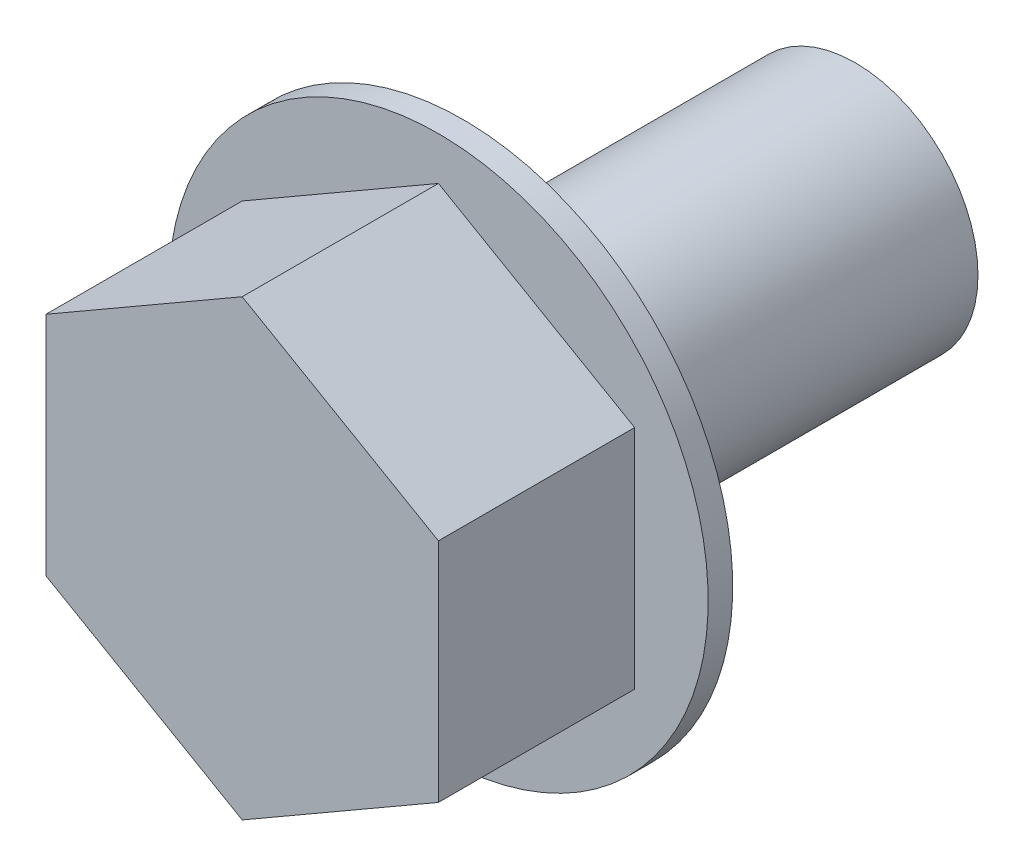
ISO-10303-21;
HEADER;
FILE_DESCRIPTION(('STEP AP214'),'2;1');
FILE_NAME('part.step','',(''),(''),'','','');
FILE_SCHEMA(('AUTOMOTIVE_DESIGN { 1 0 10303 214 1 1 1 1 }'));
ENDSEC;
DATA;
#1=APPLICATION_CONTEXT('core data for automotive mechanical design processes');
#2=APPLICATION_PROTOCOL_DEFINITION('international standard','automotive_design',2000,#1);
#3=PRODUCT_CONTEXT('',#1,'mechanical');
#4=PRODUCT('Part','Part','',(#3));
#5=PRODUCT_RELATED_PRODUCT_CATEGORY('part','',(#4));
#6=PRODUCT_DEFINITION_FORMATION('','',#4);
#7=PRODUCT_DEFINITION_CONTEXT('part definition',#1,'design');
#8=PRODUCT_DEFINITION('design','',#6,#7);
#9=PRODUCT_DEFINITION_SHAPE('','',#8);
#10=(LENGTH_UNIT() NAMED_UNIT(*) SI_UNIT(.MILLI.,.METRE.));
#11=(NAMED_UNIT(*) PLANE_ANGLE_UNIT() SI_UNIT($,.RADIAN.));
#12=(NAMED_UNIT(*) SI_UNIT($,.STERADIAN.) SOLID_ANGLE_UNIT());
#13=UNCERTAINTY_MEASURE_WITH_UNIT(LENGTH_MEASURE(1.E-05),#10,'distance_accuracy_value','');
#14=(GEOMETRIC_REPRESENTATION_CONTEXT(3) GLOBAL_UNCERTAINTY_ASSIGNED_CONTEXT((#13)) GLOBAL_UNIT_ASSIGNED_CONTEXT((#10,
#11,#12)) REPRESENTATION_CONTEXT('',''));
#15=CARTESIAN_POINT('',(0.,0.,0.));
#16=DIRECTION('',(0.,0.,1.));
#17=DIRECTION('',(1.,0.,0.));
#18=AXIS2_PLACEMENT_3D('',#15,#16,#17);
#19=CARTESIAN_POINT('',(0.,0.,-30.));
#20=DIRECTION('',(0.,0.,-1.));
#21=DIRECTION('',(-1.,0.,0.));
#22=AXIS2_PLACEMENT_3D('',#19,#20,#21);
#23=CYLINDRICAL_SURFACE('',#22,2.5);
#24=CARTESIAN_POINT('',(0.,0.,0.));
#25=DIRECTION('',(0.,0.,-1.));
#26=DIRECTION('',(-1.,0.,0.));
#27=AXIS2_PLACEMENT_3D('',#24,#25,#26);
#28=CIRCLE('',#27,2.5);
#29=CARTESIAN_POINT('',(-2.5,0.,0.));
#30=VERTEX_POINT('',#29);
#31=EDGE_CURVE('E9',#30,#30,#28,.T.);
#32=ORIENTED_EDGE('',*,*,#31,.T.);
#33=EDGE_LOOP('',(#32));
#34=FACE_BOUND('',#33,.T.);
#35=CARTESIAN_POINT('',(0.,0.,-8.));
#36=DIRECTION('',(0.,0.,-1.));
#37=DIRECTION('',(-1.,0.,0.));
#38=AXIS2_PLACEMENT_3D('',#35,#36,#37);
#39=CIRCLE('',#38,2.5);
#40=CARTESIAN_POINT('',(-2.5,0.,-8.));
#41=VERTEX_POINT('',#40);
#42=EDGE_CURVE('E109',#41,#41,#39,.T.);
#43=ORIENTED_EDGE('',*,*,#42,.F.);
#44=EDGE_LOOP('',(#43));
#45=FACE_BOUND('',#44,.T.);
#46=ADVANCED_FACE('F14',(#34,#45),#23,.T.);
#47=CARTESIAN_POINT('',(0.,2.5,0.));
#48=DIRECTION('',(0.,0.,-1.));
#49=DIRECTION('',(-1.,0.,0.));
#50=AXIS2_PLACEMENT_3D('',#47,#48,#49);
#51=PLANE('',#50);
#52=CARTESIAN_POINT('',(0.,0.,0.));
#53=DIRECTION('',(0.,0.,-1.));
#54=DIRECTION('',(-1.,0.,0.));
#55=AXIS2_PLACEMENT_3D('',#52,#53,#54);
#56=CIRCLE('',#55,5.5);
#57=CARTESIAN_POINT('',(-5.5,0.,0.));
#58=VERTEX_POINT('',#57);
#59=EDGE_CURVE('E21',#58,#58,#56,.T.);
#60=ORIENTED_EDGE('',*,*,#59,.T.);
#61=EDGE_LOOP('',(#60));
#62=FACE_BOUND('',#61,.T.);
#63=ORIENTED_EDGE('',*,*,#31,.F.);
#64=EDGE_LOOP('',(#63));
#65=FACE_BOUND('',#64,.T.);
#66=ADVANCED_FACE('F118',(#62,#65),#51,.T.);
#67=CARTESIAN_POINT('',(0.,0.,-30.));
#68=DIRECTION('',(0.,0.,-1.));
#69=DIRECTION('',(-1.,0.,0.));
#70=AXIS2_PLACEMENT_3D('',#67,#68,#69);
#71=CYLINDRICAL_SURFACE('',#70,5.5);
#72=CARTESIAN_POINT('',(0.,0.,0.5));
#73=DIRECTION('',(0.,0.,-1.));
#74=DIRECTION('',(-1.,0.,0.));
#75=AXIS2_PLACEMENT_3D('',#72,#73,#74);
#76=CIRCLE('',#75,5.5);
#77=CARTESIAN_POINT('',(-5.5,0.,0.5));
#78=VERTEX_POINT('',#77);
#79=EDGE_CURVE('E112',#78,#78,#76,.T.);
#80=ORIENTED_EDGE('',*,*,#79,.T.);
#81=EDGE_LOOP('',(#80));
#82=FACE_BOUND('',#81,.T.);
#83=ORIENTED_EDGE('',*,*,#59,.F.);
#84=EDGE_LOOP('',(#83));
#85=FACE_BOUND('',#84,.T.);
#86=ADVANCED_FACE('F121',(#82,#85),#71,.T.);
#87=CARTESIAN_POINT('',(0.,5.5,0.5));
#88=DIRECTION('',(0.,0.,1.));
#89=DIRECTION('',(1.,0.,0.));
#90=AXIS2_PLACEMENT_3D('',#87,#88,#89);
#91=PLANE('',#90);
#92=ORIENTED_EDGE('',*,*,#79,.F.);
#93=EDGE_LOOP('',(#92));
#94=FACE_BOUND('',#93,.T.);
#95=DIRECTION('',(-0.866025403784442,-0.499999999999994,0.));
#96=VECTOR('',#95,1.);
#97=CARTESIAN_POINT('',(-4.,2.30940107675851,0.5));
#98=LINE('',#97,#96);
#99=CARTESIAN_POINT('',(0.,4.61880215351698,0.5));
#100=VERTEX_POINT('',#99);
#101=CARTESIAN_POINT('',(-4.,2.30940107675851,0.5));
#102=VERTEX_POINT('',#101);
#103=EDGE_CURVE('E71',#100,#102,#98,.T.);
#104=ORIENTED_EDGE('',*,*,#103,.F.);
#105=DIRECTION('',(0.866025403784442,-0.499999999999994,0.));
#106=VECTOR('',#105,1.);
#107=CARTESIAN_POINT('',(4.,2.30940107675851,0.5));
#108=LINE('',#107,#106);
#109=CARTESIAN_POINT('',(4.,2.30940107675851,0.5));
#110=VERTEX_POINT('',#109);
#111=EDGE_CURVE('E113',#100,#110,#108,.T.);
#112=ORIENTED_EDGE('',*,*,#111,.T.);
#113=DIRECTION('',(0.,1.,0.));
#114=VECTOR('',#113,1.);
#115=CARTESIAN_POINT('',(4.,2.30940107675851,0.5));
#116=LINE('',#115,#114);
#117=CARTESIAN_POINT('',(4.,-2.30940107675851,0.5));
#118=VERTEX_POINT('',#117);
#119=EDGE_CURVE('E188',#118,#110,#116,.T.);
#120=ORIENTED_EDGE('',*,*,#119,.F.);
#121=DIRECTION('',(0.866025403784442,0.499999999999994,0.));
#122=VECTOR('',#121,1.);
#123=CARTESIAN_POINT('',(4.,-2.30940107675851,0.5));
#124=LINE('',#123,#122);
#125=CARTESIAN_POINT('',(0.,-4.61880215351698,0.5));
#126=VERTEX_POINT('',#125);
#127=EDGE_CURVE('E183',#126,#118,#124,.T.);
#128=ORIENTED_EDGE('',*,*,#127,.F.);
#129=DIRECTION('',(-0.866025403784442,0.499999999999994,0.));
#130=VECTOR('',#129,1.);
#131=CARTESIAN_POINT('',(-4.,-2.30940107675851,0.5));
#132=LINE('',#131,#130);
#133=CARTESIAN_POINT('',(-4.,-2.30940107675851,0.5));
#134=VERTEX_POINT('',#133);
#135=EDGE_CURVE('E185',#126,#134,#132,.T.);
#136=ORIENTED_EDGE('',*,*,#135,.T.);
#137=DIRECTION('',(0.,1.,0.));
#138=VECTOR('',#137,1.);
#139=CARTESIAN_POINT('',(-4.,2.30940107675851,0.5));
#140=LINE('',#139,#138);
#141=EDGE_CURVE('E108',#134,#102,#140,.T.);
#142=ORIENTED_EDGE('',*,*,#141,.T.);
#143=EDGE_LOOP('',(#104,#112,#120,#128,#136,#142));
#144=FACE_BOUND('',#143,.T.);
#145=ADVANCED_FACE('F123',(#94,#144),#91,.T.);
#146=CARTESIAN_POINT('',(0.,2.5,-8.));
#147=DIRECTION('',(0.,0.,1.));
#148=DIRECTION('',(1.,0.,0.));
#149=AXIS2_PLACEMENT_3D('',#146,#147,#148);
#150=PLANE('',#149);
#151=ORIENTED_EDGE('',*,*,#42,.T.);
#152=EDGE_LOOP('',(#151));
#153=FACE_BOUND('',#152,.T.);
#154=ADVANCED_FACE('F132',(#153),#150,.F.);
#155=CARTESIAN_POINT('',(-4.,2.30940107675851,-11.7202018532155));
#156=DIRECTION('',(0.499999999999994,-0.866025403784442,0.));
#157=DIRECTION('',(0.866025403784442,0.499999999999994,0.));
#158=AXIS2_PLACEMENT_3D('',#155,#156,#157);
#159=PLANE('',#158);
#160=DIRECTION('',(0.,0.,1.));
#161=VECTOR('',#160,1.);
#162=CARTESIAN_POINT('',(0.,4.61880215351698,-11.7202018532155));
#163=LINE('',#162,#161);
#164=CARTESIAN_POINT('',(0.,4.61880215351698,4.5));
#165=VERTEX_POINT('',#164);
#166=EDGE_CURVE('E75',#100,#165,#163,.T.);
#167=ORIENTED_EDGE('',*,*,#166,.F.);
#168=ORIENTED_EDGE('',*,*,#103,.T.);
#169=DIRECTION('',(0.,0.,1.));
#170=VECTOR('',#169,1.);
#171=CARTESIAN_POINT('',(-4.,2.30940107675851,-11.7202018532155));
#172=LINE('',#171,#170);
#173=CARTESIAN_POINT('',(-4.,2.30940107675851,4.5));
#174=VERTEX_POINT('',#173);
#175=EDGE_CURVE('E67',#102,#174,#172,.T.);
#176=ORIENTED_EDGE('',*,*,#175,.T.);
#177=DIRECTION('',(0.866025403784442,0.499999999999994,0.));
#178=VECTOR('',#177,1.);
#179=CARTESIAN_POINT('',(-4.,2.30940107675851,4.5));
#180=LINE('',#179,#178);
#181=EDGE_CURVE('E28',#174,#165,#180,.T.);
#182=ORIENTED_EDGE('',*,*,#181,.T.);
#183=EDGE_LOOP('',(#167,#168,#176,#182));
#184=FACE_BOUND('',#183,.T.);
#185=ADVANCED_FACE('F69',(#184),#159,.F.);
#186=CARTESIAN_POINT('',(-4.,2.30940107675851,-11.7202018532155));
#187=DIRECTION('',(-1.,0.,0.));
#188=DIRECTION('',(0.,0.,1.));
#189=AXIS2_PLACEMENT_3D('',#186,#187,#188);
#190=PLANE('',#189);
#191=ORIENTED_EDGE('',*,*,#141,.F.);
#192=DIRECTION('',(0.,0.,1.));
#193=VECTOR('',#192,1.);
#194=CARTESIAN_POINT('',(-4.,-2.30940107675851,-11.7202018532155));
#195=LINE('',#194,#193);
#196=CARTESIAN_POINT('',(-4.,-2.30940107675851,4.5));
#197=VERTEX_POINT('',#196);
#198=EDGE_CURVE('E74',#134,#197,#195,.T.);
#199=ORIENTED_EDGE('',*,*,#198,.T.);
#200=DIRECTION('',(0.,-1.,0.));
#201=VECTOR('',#200,1.);
#202=CARTESIAN_POINT('',(-4.,2.30940107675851,4.5));
#203=LINE('',#202,#201);
#204=EDGE_CURVE('E78',#174,#197,#203,.T.);
#205=ORIENTED_EDGE('',*,*,#204,.F.);
#206=ORIENTED_EDGE('',*,*,#175,.F.);
#207=EDGE_LOOP('',(#191,#199,#205,#206));
#208=FACE_BOUND('',#207,.T.);
#209=ADVANCED_FACE('F79',(#208),#190,.T.);
#210=CARTESIAN_POINT('',(-4.,-2.30940107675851,-11.7202018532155));
#211=DIRECTION('',(-0.499999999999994,-0.866025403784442,0.));
#212=DIRECTION('',(0.866025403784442,-0.499999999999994,0.));
#213=AXIS2_PLACEMENT_3D('',#210,#211,#212);
#214=PLANE('',#213);
#215=ORIENTED_EDGE('',*,*,#135,.F.);
#216=DIRECTION('',(0.,0.,1.));
#217=VECTOR('',#216,1.);
#218=CARTESIAN_POINT('',(0.,-4.61880215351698,-11.7202018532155));
#219=LINE('',#218,#217);
#220=CARTESIAN_POINT('',(0.,-4.61880215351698,4.5));
#221=VERTEX_POINT('',#220);
#222=EDGE_CURVE('E102',#126,#221,#219,.T.);
#223=ORIENTED_EDGE('',*,*,#222,.T.);
#224=DIRECTION('',(0.866025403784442,-0.499999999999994,0.));
#225=VECTOR('',#224,1.);
#226=CARTESIAN_POINT('',(-4.,-2.30940107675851,4.5));
#227=LINE('',#226,#225);
#228=EDGE_CURVE('E84',#197,#221,#227,.T.);
#229=ORIENTED_EDGE('',*,*,#228,.F.);
#230=ORIENTED_EDGE('',*,*,#198,.F.);
#231=EDGE_LOOP('',(#215,#223,#229,#230));
#232=FACE_BOUND('',#231,.T.);
#233=ADVANCED_FACE('F172',(#232),#214,.T.);
#234=CARTESIAN_POINT('',(4.,-2.30940107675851,-11.7202018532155));
#235=DIRECTION('',(-0.499999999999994,0.866025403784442,0.));
#236=DIRECTION('',(-0.866025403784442,-0.499999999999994,0.));
#237=AXIS2_PLACEMENT_3D('',#234,#235,#236);
#238=PLANE('',#237);
#239=ORIENTED_EDGE('',*,*,#222,.F.);
#240=ORIENTED_EDGE('',*,*,#127,.T.);
#241=DIRECTION('',(0.,0.,1.));
#242=VECTOR('',#241,1.);
#243=CARTESIAN_POINT('',(4.,-2.30940107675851,-11.7202018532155));
#244=LINE('',#243,#242);
#245=CARTESIAN_POINT('',(4.,-2.30940107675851,4.5));
#246=VERTEX_POINT('',#245);
#247=EDGE_CURVE('E104',#118,#246,#244,.T.);
#248=ORIENTED_EDGE('',*,*,#247,.T.);
#249=DIRECTION('',(-0.866025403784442,-0.499999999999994,0.));
#250=VECTOR('',#249,1.);
#251=CARTESIAN_POINT('',(4.,-2.30940107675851,4.5));
#252=LINE('',#251,#250);
#253=EDGE_CURVE('E95',#246,#221,#252,.T.);
#254=ORIENTED_EDGE('',*,*,#253,.T.);
#255=EDGE_LOOP('',(#239,#240,#248,#254));
#256=FACE_BOUND('',#255,.T.);
#257=ADVANCED_FACE('F167',(#256),#238,.F.);
#258=CARTESIAN_POINT('',(4.,2.30940107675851,-11.7202018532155));
#259=DIRECTION('',(-1.,0.,0.));
#260=DIRECTION('',(0.,0.,1.));
#261=AXIS2_PLACEMENT_3D('',#258,#259,#260);
#262=PLANE('',#261);
#263=ORIENTED_EDGE('',*,*,#247,.F.);
#264=ORIENTED_EDGE('',*,*,#119,.T.);
#265=DIRECTION('',(0.,0.,1.));
#266=VECTOR('',#265,1.);
#267=CARTESIAN_POINT('',(4.,2.30940107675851,-11.7202018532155));
#268=LINE('',#267,#266);
#269=CARTESIAN_POINT('',(4.,2.30940107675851,4.5));
#270=VERTEX_POINT('',#269);
#271=EDGE_CURVE('E36',#110,#270,#268,.T.);
#272=ORIENTED_EDGE('',*,*,#271,.T.);
#273=DIRECTION('',(0.,-1.,0.));
#274=VECTOR('',#273,1.);
#275=CARTESIAN_POINT('',(4.,2.30940107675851,4.5));
#276=LINE('',#275,#274);
#277=EDGE_CURVE('E98',#270,#246,#276,.T.);
#278=ORIENTED_EDGE('',*,*,#277,.T.);
#279=EDGE_LOOP('',(#263,#264,#272,#278));
#280=FACE_BOUND('',#279,.T.);
#281=ADVANCED_FACE('F153',(#280),#262,.F.);
#282=CARTESIAN_POINT('',(4.,2.30940107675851,-11.7202018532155));
#283=DIRECTION('',(0.499999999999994,0.866025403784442,0.));
#284=DIRECTION('',(-0.866025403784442,0.499999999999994,0.));
#285=AXIS2_PLACEMENT_3D('',#282,#283,#284);
#286=PLANE('',#285);
#287=ORIENTED_EDGE('',*,*,#111,.F.);
#288=ORIENTED_EDGE('',*,*,#166,.T.);
#289=DIRECTION('',(-0.866025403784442,0.499999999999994,0.));
#290=VECTOR('',#289,1.);
#291=CARTESIAN_POINT('',(4.,2.30940107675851,4.5));
#292=LINE('',#291,#290);
#293=EDGE_CURVE('E89',#270,#165,#292,.T.);
#294=ORIENTED_EDGE('',*,*,#293,.F.);
#295=ORIENTED_EDGE('',*,*,#271,.F.);
#296=EDGE_LOOP('',(#287,#288,#294,#295));
#297=FACE_BOUND('',#296,.T.);
#298=ADVANCED_FACE('F156',(#297),#286,.T.);
#299=CARTESIAN_POINT('',(0.,4.62,4.5));
#300=DIRECTION('',(0.,0.,1.));
#301=DIRECTION('',(1.,0.,0.));
#302=AXIS2_PLACEMENT_3D('',#299,#300,#301);
#303=PLANE('',#302);
#304=ORIENTED_EDGE('',*,*,#181,.F.);
#305=ORIENTED_EDGE('',*,*,#204,.T.);
#306=ORIENTED_EDGE('',*,*,#228,.T.);
#307=ORIENTED_EDGE('',*,*,#253,.F.);
#308=ORIENTED_EDGE('',*,*,#277,.F.);
#309=ORIENTED_EDGE('',*,*,#293,.T.);
#310=EDGE_LOOP('',(#304,#305,#306,#307,#308,#309));
#311=FACE_BOUND('',#310,.T.);
#312=ADVANCED_FACE('F87',(#311),#303,.T.);
#313=CLOSED_SHELL('',(#46,#66,#86,#145,#154,#185,#209,#233,#257,#281,#298,#312));
#314=MANIFOLD_SOLID_BREP('B1',#313);
#315=ADVANCED_BREP_SHAPE_REPRESENTATION('',(#18,#314),#14);
#316=SHAPE_DEFINITION_REPRESENTATION(#9,#315);
ENDSEC;
END-ISO-10303-21;
